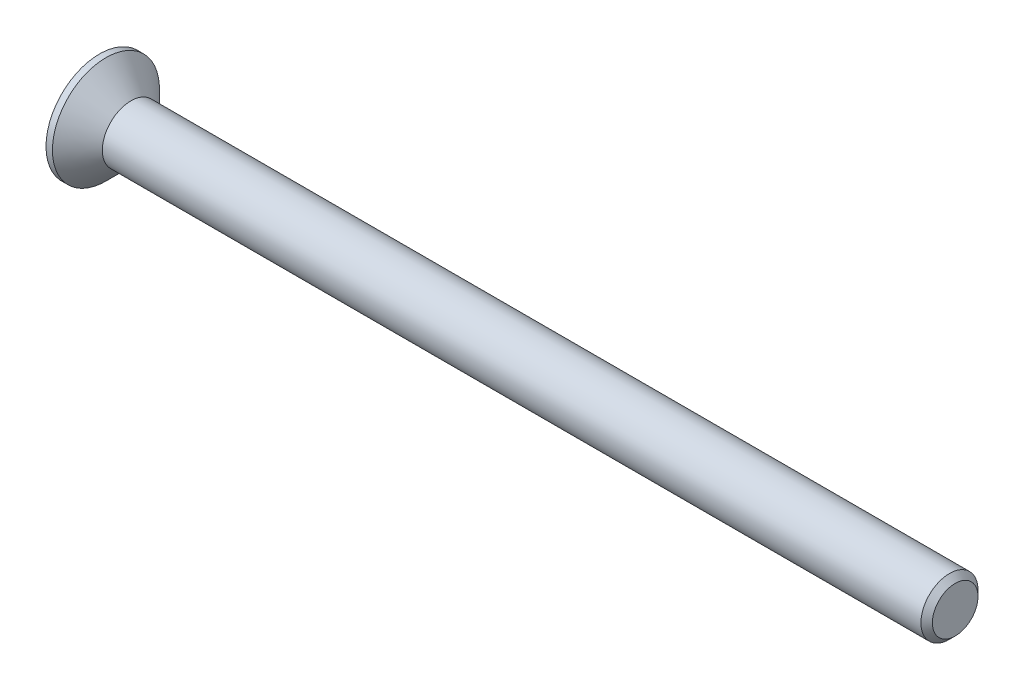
ISO-10303-21;
HEADER;
FILE_DESCRIPTION(('STEP AP214'),'2;1');
FILE_NAME('part.step','',(''),(''),'','','');
FILE_SCHEMA(('AUTOMOTIVE_DESIGN { 1 0 10303 214 1 1 1 1 }'));
ENDSEC;
DATA;
#1=APPLICATION_CONTEXT('core data for automotive mechanical design processes');
#2=APPLICATION_PROTOCOL_DEFINITION('international standard','automotive_design',2000,#1);
#3=PRODUCT_CONTEXT('',#1,'mechanical');
#4=PRODUCT('Part','Part','',(#3));
#5=PRODUCT_RELATED_PRODUCT_CATEGORY('part','',(#4));
#6=PRODUCT_DEFINITION_FORMATION('','',#4);
#7=PRODUCT_DEFINITION_CONTEXT('part definition',#1,'design');
#8=PRODUCT_DEFINITION('design','',#6,#7);
#9=PRODUCT_DEFINITION_SHAPE('','',#8);
#10=(LENGTH_UNIT() NAMED_UNIT(*) SI_UNIT(.MILLI.,.METRE.));
#11=(NAMED_UNIT(*) PLANE_ANGLE_UNIT() SI_UNIT($,.RADIAN.));
#12=(NAMED_UNIT(*) SI_UNIT($,.STERADIAN.) SOLID_ANGLE_UNIT());
#13=UNCERTAINTY_MEASURE_WITH_UNIT(LENGTH_MEASURE(1.E-05),#10,'distance_accuracy_value','');
#14=(GEOMETRIC_REPRESENTATION_CONTEXT(3) GLOBAL_UNCERTAINTY_ASSIGNED_CONTEXT((#13)) GLOBAL_UNIT_ASSIGNED_CONTEXT((#10,
#11,#12)) REPRESENTATION_CONTEXT('',''));
#15=CARTESIAN_POINT('',(0.,0.,0.));
#16=DIRECTION('',(0.,0.,1.));
#17=DIRECTION('',(1.,0.,0.));
#18=AXIS2_PLACEMENT_3D('',#15,#16,#17);
#19=CARTESIAN_POINT('',(0.,0.,0.));
#20=DIRECTION('',(-1.,0.,0.));
#21=DIRECTION('',(0.,0.,1.));
#22=AXIS2_PLACEMENT_3D('',#19,#20,#21);
#23=CONICAL_SURFACE('',#22,2.,0.78539816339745);
#24=CARTESIAN_POINT('',(-1.74999999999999,0.,0.));
#25=DIRECTION('',(-1.,0.,0.));
#26=DIRECTION('',(0.,0.,1.));
#27=AXIS2_PLACEMENT_3D('',#24,#25,#26);
#28=CIRCLE('',#27,3.75);
#29=CARTESIAN_POINT('',(-1.74999999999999,0.,3.75));
#30=VERTEX_POINT('',#29);
#31=EDGE_CURVE('E189',#30,#30,#28,.T.);
#32=ORIENTED_EDGE('',*,*,#31,.F.);
#33=EDGE_LOOP('',(#32));
#34=FACE_BOUND('',#33,.T.);
#35=CARTESIAN_POINT('',(0.,0.,0.));
#36=DIRECTION('',(-1.,0.,0.));
#37=DIRECTION('',(0.,0.,1.));
#38=AXIS2_PLACEMENT_3D('',#35,#36,#37);
#39=CIRCLE('',#38,2.);
#40=CARTESIAN_POINT('',(0.,0.,2.));
#41=VERTEX_POINT('',#40);
#42=EDGE_CURVE('E212',#41,#41,#39,.T.);
#43=ORIENTED_EDGE('',*,*,#42,.T.);
#44=EDGE_LOOP('',(#43));
#45=FACE_BOUND('',#44,.T.);
#46=ADVANCED_FACE('F33',(#34,#45),#23,.T.);
#47=CARTESIAN_POINT('',(-2.2,0.,0.));
#48=DIRECTION('',(-1.,0.,0.));
#49=DIRECTION('',(0.,0.,1.));
#50=AXIS2_PLACEMENT_3D('',#47,#48,#49);
#51=CYLINDRICAL_SURFACE('',#50,2.);
#52=CARTESIAN_POINT('',(57.4,0.,0.));
#53=DIRECTION('',(-1.,0.,0.));
#54=DIRECTION('',(0.,0.,1.));
#55=AXIS2_PLACEMENT_3D('',#52,#53,#54);
#56=CIRCLE('',#55,2.);
#57=CARTESIAN_POINT('',(57.4,0.,2.));
#58=VERTEX_POINT('',#57);
#59=EDGE_CURVE('E41',#58,#58,#56,.T.);
#60=ORIENTED_EDGE('',*,*,#59,.T.);
#61=EDGE_LOOP('',(#60));
#62=FACE_BOUND('',#61,.T.);
#63=ORIENTED_EDGE('',*,*,#42,.F.);
#64=EDGE_LOOP('',(#63));
#65=FACE_BOUND('',#64,.T.);
#66=ADVANCED_FACE('F217',(#62,#65),#51,.T.);
#67=CARTESIAN_POINT('',(57.8,0.,0.));
#68=DIRECTION('',(-1.,0.,0.));
#69=DIRECTION('',(0.,0.,1.));
#70=AXIS2_PLACEMENT_3D('',#67,#68,#69);
#71=PLANE('',#70);
#72=CARTESIAN_POINT('',(57.8,0.,0.));
#73=DIRECTION('',(-1.,0.,0.));
#74=DIRECTION('',(0.,0.,1.));
#75=AXIS2_PLACEMENT_3D('',#72,#73,#74);
#76=CIRCLE('',#75,1.59999999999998);
#77=CARTESIAN_POINT('',(57.8,0.,1.59999999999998));
#78=VERTEX_POINT('',#77);
#79=EDGE_CURVE('E11',#78,#78,#76,.F.);
#80=ORIENTED_EDGE('',*,*,#79,.T.);
#81=EDGE_LOOP('',(#80));
#82=FACE_BOUND('',#81,.T.);
#83=ADVANCED_FACE('F239',(#82),#71,.F.);
#84=CARTESIAN_POINT('',(-2.2,3.75,0.));
#85=DIRECTION('',(1.,0.,0.));
#86=DIRECTION('',(0.,0.,-1.));
#87=AXIS2_PLACEMENT_3D('',#84,#85,#86);
#88=PLANE('',#87);
#89=DIRECTION('',(0.,0.,-1.));
#90=VECTOR('',#89,1.);
#91=CARTESIAN_POINT('',(-2.2,0.55,-2.2));
#92=LINE('',#91,#90);
#93=CARTESIAN_POINT('',(-2.2,0.55,-0.55));
#94=VERTEX_POINT('',#93);
#95=CARTESIAN_POINT('',(-2.2,0.55,-2.2));
#96=VERTEX_POINT('',#95);
#97=EDGE_CURVE('E158',#94,#96,#92,.T.);
#98=ORIENTED_EDGE('',*,*,#97,.F.);
#99=DIRECTION('',(0.,-1.,0.));
#100=VECTOR('',#99,1.);
#101=CARTESIAN_POINT('',(-2.2,0.55,-0.55));
#102=LINE('',#101,#100);
#103=CARTESIAN_POINT('',(-2.2,2.2,-0.55));
#104=VERTEX_POINT('',#103);
#105=EDGE_CURVE('E48',#104,#94,#102,.T.);
#106=ORIENTED_EDGE('',*,*,#105,.F.);
#107=DIRECTION('',(0.,0.,-1.));
#108=VECTOR('',#107,1.);
#109=CARTESIAN_POINT('',(-2.2,2.2,-0.55));
#110=LINE('',#109,#108);
#111=CARTESIAN_POINT('',(-2.2,2.2,0.55));
#112=VERTEX_POINT('',#111);
#113=EDGE_CURVE('E185',#112,#104,#110,.T.);
#114=ORIENTED_EDGE('',*,*,#113,.F.);
#115=DIRECTION('',(0.,1.,0.));
#116=VECTOR('',#115,1.);
#117=CARTESIAN_POINT('',(-2.2,2.2,0.55));
#118=LINE('',#117,#116);
#119=CARTESIAN_POINT('',(-2.2,0.55,0.55));
#120=VERTEX_POINT('',#119);
#121=EDGE_CURVE('E183',#120,#112,#118,.T.);
#122=ORIENTED_EDGE('',*,*,#121,.F.);
#123=DIRECTION('',(0.,0.,-1.));
#124=VECTOR('',#123,1.);
#125=CARTESIAN_POINT('',(-2.2,0.55,0.55));
#126=LINE('',#125,#124);
#127=CARTESIAN_POINT('',(-2.2,0.55,2.2));
#128=VERTEX_POINT('',#127);
#129=EDGE_CURVE('E132',#128,#120,#126,.T.);
#130=ORIENTED_EDGE('',*,*,#129,.F.);
#131=DIRECTION('',(0.,1.,0.));
#132=VECTOR('',#131,1.);
#133=CARTESIAN_POINT('',(-2.2,0.55,2.2));
#134=LINE('',#133,#132);
#135=CARTESIAN_POINT('',(-2.2,-0.55,2.2));
#136=VERTEX_POINT('',#135);
#137=EDGE_CURVE('E179',#136,#128,#134,.T.);
#138=ORIENTED_EDGE('',*,*,#137,.F.);
#139=DIRECTION('',(0.,0.,1.));
#140=VECTOR('',#139,1.);
#141=CARTESIAN_POINT('',(-2.2,-0.55,2.2));
#142=LINE('',#141,#140);
#143=CARTESIAN_POINT('',(-2.2,-0.55,0.55));
#144=VERTEX_POINT('',#143);
#145=EDGE_CURVE('E176',#144,#136,#142,.T.);
#146=ORIENTED_EDGE('',*,*,#145,.F.);
#147=DIRECTION('',(0.,1.,0.));
#148=VECTOR('',#147,1.);
#149=CARTESIAN_POINT('',(-2.2,-0.55,0.55));
#150=LINE('',#149,#148);
#151=CARTESIAN_POINT('',(-2.2,-2.2,0.55));
#152=VERTEX_POINT('',#151);
#153=EDGE_CURVE('E173',#152,#144,#150,.T.);
#154=ORIENTED_EDGE('',*,*,#153,.F.);
#155=DIRECTION('',(0.,0.,1.));
#156=VECTOR('',#155,1.);
#157=CARTESIAN_POINT('',(-2.2,-2.2,0.55));
#158=LINE('',#157,#156);
#159=CARTESIAN_POINT('',(-2.2,-2.2,-0.55));
#160=VERTEX_POINT('',#159);
#161=EDGE_CURVE('E170',#160,#152,#158,.T.);
#162=ORIENTED_EDGE('',*,*,#161,.F.);
#163=DIRECTION('',(0.,-1.,0.));
#164=VECTOR('',#163,1.);
#165=CARTESIAN_POINT('',(-2.2,-2.2,-0.55));
#166=LINE('',#165,#164);
#167=CARTESIAN_POINT('',(-2.2,-0.55,-0.55));
#168=VERTEX_POINT('',#167);
#169=EDGE_CURVE('E167',#168,#160,#166,.T.);
#170=ORIENTED_EDGE('',*,*,#169,.F.);
#171=DIRECTION('',(0.,0.,1.));
#172=VECTOR('',#171,1.);
#173=CARTESIAN_POINT('',(-2.2,-0.55,-0.55));
#174=LINE('',#173,#172);
#175=CARTESIAN_POINT('',(-2.2,-0.55,-2.2));
#176=VERTEX_POINT('',#175);
#177=EDGE_CURVE('E164',#176,#168,#174,.T.);
#178=ORIENTED_EDGE('',*,*,#177,.F.);
#179=DIRECTION('',(0.,-1.,0.));
#180=VECTOR('',#179,1.);
#181=CARTESIAN_POINT('',(-2.2,-0.55,-2.2));
#182=LINE('',#181,#180);
#183=EDGE_CURVE('E161',#96,#176,#182,.T.);
#184=ORIENTED_EDGE('',*,*,#183,.F.);
#185=EDGE_LOOP('',(#98,#106,#114,#122,#130,#138,#146,#154,#162,#170,#178,#184));
#186=FACE_BOUND('',#185,.T.);
#187=CARTESIAN_POINT('',(-2.2,0.,0.));
#188=DIRECTION('',(-1.,0.,0.));
#189=DIRECTION('',(0.,0.,1.));
#190=AXIS2_PLACEMENT_3D('',#187,#188,#189);
#191=CIRCLE('',#190,3.75);
#192=CARTESIAN_POINT('',(-2.2,0.,3.75));
#193=VERTEX_POINT('',#192);
#194=EDGE_CURVE('E209',#193,#193,#191,.T.);
#195=ORIENTED_EDGE('',*,*,#194,.T.);
#196=EDGE_LOOP('',(#195));
#197=FACE_BOUND('',#196,.T.);
#198=ADVANCED_FACE('F230',(#186,#197),#88,.F.);
#199=CARTESIAN_POINT('',(-2.2,0.,0.));
#200=DIRECTION('',(-1.,0.,0.));
#201=DIRECTION('',(0.,0.,1.));
#202=AXIS2_PLACEMENT_3D('',#199,#200,#201);
#203=CYLINDRICAL_SURFACE('',#202,3.75);
#204=ORIENTED_EDGE('',*,*,#194,.F.);
#205=EDGE_LOOP('',(#204));
#206=FACE_BOUND('',#205,.T.);
#207=ORIENTED_EDGE('',*,*,#31,.T.);
#208=EDGE_LOOP('',(#207));
#209=FACE_BOUND('',#208,.T.);
#210=ADVANCED_FACE('F222',(#206,#209),#203,.T.);
#211=CARTESIAN_POINT('',(57.4,0.,0.));
#212=DIRECTION('',(-1.,0.,0.));
#213=DIRECTION('',(0.,0.,1.));
#214=AXIS2_PLACEMENT_3D('',#211,#212,#213);
#215=CONICAL_SURFACE('',#214,2.,0.785398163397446);
#216=ORIENTED_EDGE('',*,*,#79,.F.);
#217=EDGE_LOOP('',(#216));
#218=FACE_BOUND('',#217,.T.);
#219=ORIENTED_EDGE('',*,*,#59,.F.);
#220=EDGE_LOOP('',(#219));
#221=FACE_BOUND('',#220,.T.);
#222=ADVANCED_FACE('F35',(#218,#221),#215,.T.);
#223=CARTESIAN_POINT('',(-0.3,0.55,-0.55));
#224=DIRECTION('',(0.,0.,-1.));
#225=DIRECTION('',(-1.,0.,0.));
#226=AXIS2_PLACEMENT_3D('',#223,#224,#225);
#227=PLANE('',#226);
#228=ORIENTED_EDGE('',*,*,#105,.T.);
#229=DIRECTION('',(-1.,0.,0.));
#230=VECTOR('',#229,1.);
#231=CARTESIAN_POINT('',(-0.3,0.55,-0.55));
#232=LINE('',#231,#230);
#233=CARTESIAN_POINT('',(-0.3,0.55,-0.55));
#234=VERTEX_POINT('',#233);
#235=EDGE_CURVE('E96',#234,#94,#232,.T.);
#236=ORIENTED_EDGE('',*,*,#235,.F.);
#237=DIRECTION('',(0.,-1.,0.));
#238=VECTOR('',#237,1.);
#239=CARTESIAN_POINT('',(-0.3,0.55,-0.55));
#240=LINE('',#239,#238);
#241=CARTESIAN_POINT('',(-0.3,2.2,-0.55));
#242=VERTEX_POINT('',#241);
#243=EDGE_CURVE('E187',#242,#234,#240,.T.);
#244=ORIENTED_EDGE('',*,*,#243,.F.);
#245=DIRECTION('',(-1.,0.,0.));
#246=VECTOR('',#245,1.);
#247=CARTESIAN_POINT('',(-0.3,2.2,-0.55));
#248=LINE('',#247,#246);
#249=EDGE_CURVE('E56',#242,#104,#248,.T.);
#250=ORIENTED_EDGE('',*,*,#249,.T.);
#251=EDGE_LOOP('',(#228,#236,#244,#250));
#252=FACE_BOUND('',#251,.T.);
#253=ADVANCED_FACE('F221',(#252),#227,.F.);
#254=CARTESIAN_POINT('',(-0.3,2.2,-0.55));
#255=DIRECTION('',(0.,1.,0.));
#256=DIRECTION('',(-1.,0.,0.));
#257=AXIS2_PLACEMENT_3D('',#254,#255,#256);
#258=PLANE('',#257);
#259=ORIENTED_EDGE('',*,*,#113,.T.);
#260=ORIENTED_EDGE('',*,*,#249,.F.);
#261=DIRECTION('',(0.,0.,-1.));
#262=VECTOR('',#261,1.);
#263=CARTESIAN_POINT('',(-0.3,2.2,-0.55));
#264=LINE('',#263,#262);
#265=CARTESIAN_POINT('',(-0.3,2.2,0.55));
#266=VERTEX_POINT('',#265);
#267=EDGE_CURVE('E144',#266,#242,#264,.T.);
#268=ORIENTED_EDGE('',*,*,#267,.F.);
#269=DIRECTION('',(-1.,0.,0.));
#270=VECTOR('',#269,1.);
#271=CARTESIAN_POINT('',(-0.3,2.2,0.55));
#272=LINE('',#271,#270);
#273=EDGE_CURVE('E136',#266,#112,#272,.T.);
#274=ORIENTED_EDGE('',*,*,#273,.T.);
#275=EDGE_LOOP('',(#259,#260,#268,#274));
#276=FACE_BOUND('',#275,.T.);
#277=ADVANCED_FACE('F228',(#276),#258,.F.);
#278=CARTESIAN_POINT('',(-0.3,2.2,0.55));
#279=DIRECTION('',(0.,0.,1.));
#280=DIRECTION('',(1.,0.,0.));
#281=AXIS2_PLACEMENT_3D('',#278,#279,#280);
#282=PLANE('',#281);
#283=ORIENTED_EDGE('',*,*,#121,.T.);
#284=ORIENTED_EDGE('',*,*,#273,.F.);
#285=DIRECTION('',(0.,1.,0.));
#286=VECTOR('',#285,1.);
#287=CARTESIAN_POINT('',(-0.3,2.2,0.55));
#288=LINE('',#287,#286);
#289=CARTESIAN_POINT('',(-0.3,0.55,0.55));
#290=VERTEX_POINT('',#289);
#291=EDGE_CURVE('E140',#290,#266,#288,.T.);
#292=ORIENTED_EDGE('',*,*,#291,.F.);
#293=DIRECTION('',(-1.,0.,0.));
#294=VECTOR('',#293,1.);
#295=CARTESIAN_POINT('',(-0.3,0.55,0.55));
#296=LINE('',#295,#294);
#297=EDGE_CURVE('E125',#290,#120,#296,.T.);
#298=ORIENTED_EDGE('',*,*,#297,.T.);
#299=EDGE_LOOP('',(#283,#284,#292,#298));
#300=FACE_BOUND('',#299,.T.);
#301=ADVANCED_FACE('F141',(#300),#282,.F.);
#302=CARTESIAN_POINT('',(-0.3,0.55,0.55));
#303=DIRECTION('',(0.,1.,0.));
#304=DIRECTION('',(-1.,0.,0.));
#305=AXIS2_PLACEMENT_3D('',#302,#303,#304);
#306=PLANE('',#305);
#307=ORIENTED_EDGE('',*,*,#129,.T.);
#308=ORIENTED_EDGE('',*,*,#297,.F.);
#309=DIRECTION('',(0.,0.,-1.));
#310=VECTOR('',#309,1.);
#311=CARTESIAN_POINT('',(-0.3,0.55,0.55));
#312=LINE('',#311,#310);
#313=CARTESIAN_POINT('',(-0.3,0.55,2.2));
#314=VERTEX_POINT('',#313);
#315=EDGE_CURVE('E129',#314,#290,#312,.T.);
#316=ORIENTED_EDGE('',*,*,#315,.F.);
#317=DIRECTION('',(-1.,0.,0.));
#318=VECTOR('',#317,1.);
#319=CARTESIAN_POINT('',(-0.3,0.55,2.2));
#320=LINE('',#319,#318);
#321=EDGE_CURVE('E137',#314,#128,#320,.T.);
#322=ORIENTED_EDGE('',*,*,#321,.T.);
#323=EDGE_LOOP('',(#307,#308,#316,#322));
#324=FACE_BOUND('',#323,.T.);
#325=ADVANCED_FACE('F127',(#324),#306,.F.);
#326=CARTESIAN_POINT('',(-0.3,0.55,2.2));
#327=DIRECTION('',(0.,0.,1.));
#328=DIRECTION('',(1.,0.,0.));
#329=AXIS2_PLACEMENT_3D('',#326,#327,#328);
#330=PLANE('',#329);
#331=ORIENTED_EDGE('',*,*,#137,.T.);
#332=ORIENTED_EDGE('',*,*,#321,.F.);
#333=DIRECTION('',(0.,1.,0.));
#334=VECTOR('',#333,1.);
#335=CARTESIAN_POINT('',(-0.3,0.55,2.2));
#336=LINE('',#335,#334);
#337=CARTESIAN_POINT('',(-0.3,-0.55,2.2));
#338=VERTEX_POINT('',#337);
#339=EDGE_CURVE('E150',#338,#314,#336,.T.);
#340=ORIENTED_EDGE('',*,*,#339,.F.);
#341=DIRECTION('',(-1.,0.,0.));
#342=VECTOR('',#341,1.);
#343=CARTESIAN_POINT('',(-0.3,-0.55,2.2));
#344=LINE('',#343,#342);
#345=EDGE_CURVE('E192',#338,#136,#344,.T.);
#346=ORIENTED_EDGE('',*,*,#345,.T.);
#347=EDGE_LOOP('',(#331,#332,#340,#346));
#348=FACE_BOUND('',#347,.T.);
#349=ADVANCED_FACE('F277',(#348),#330,.F.);
#350=CARTESIAN_POINT('',(-0.3,-0.55,2.2));
#351=DIRECTION('',(0.,-1.,0.));
#352=DIRECTION('',(1.,0.,0.));
#353=AXIS2_PLACEMENT_3D('',#350,#351,#352);
#354=PLANE('',#353);
#355=ORIENTED_EDGE('',*,*,#145,.T.);
#356=ORIENTED_EDGE('',*,*,#345,.F.);
#357=DIRECTION('',(0.,0.,1.));
#358=VECTOR('',#357,1.);
#359=CARTESIAN_POINT('',(-0.3,-0.55,2.2));
#360=LINE('',#359,#358);
#361=CARTESIAN_POINT('',(-0.3,-0.55,0.55));
#362=VERTEX_POINT('',#361);
#363=EDGE_CURVE('E152',#362,#338,#360,.T.);
#364=ORIENTED_EDGE('',*,*,#363,.F.);
#365=DIRECTION('',(-1.,0.,0.));
#366=VECTOR('',#365,1.);
#367=CARTESIAN_POINT('',(-0.3,-0.55,0.55));
#368=LINE('',#367,#366);
#369=EDGE_CURVE('E194',#362,#144,#368,.T.);
#370=ORIENTED_EDGE('',*,*,#369,.T.);
#371=EDGE_LOOP('',(#355,#356,#364,#370));
#372=FACE_BOUND('',#371,.T.);
#373=ADVANCED_FACE('F273',(#372),#354,.F.);
#374=CARTESIAN_POINT('',(-0.3,-0.55,0.55));
#375=DIRECTION('',(0.,0.,1.));
#376=DIRECTION('',(1.,0.,0.));
#377=AXIS2_PLACEMENT_3D('',#374,#375,#376);
#378=PLANE('',#377);
#379=ORIENTED_EDGE('',*,*,#153,.T.);
#380=ORIENTED_EDGE('',*,*,#369,.F.);
#381=DIRECTION('',(0.,1.,0.));
#382=VECTOR('',#381,1.);
#383=CARTESIAN_POINT('',(-0.3,-0.55,0.55));
#384=LINE('',#383,#382);
#385=CARTESIAN_POINT('',(-0.3,-2.2,0.55));
#386=VERTEX_POINT('',#385);
#387=EDGE_CURVE('E422',#386,#362,#384,.T.);
#388=ORIENTED_EDGE('',*,*,#387,.F.);
#389=DIRECTION('',(-1.,0.,0.));
#390=VECTOR('',#389,1.);
#391=CARTESIAN_POINT('',(-0.3,-2.2,0.55));
#392=LINE('',#391,#390);
#393=EDGE_CURVE('E196',#386,#152,#392,.T.);
#394=ORIENTED_EDGE('',*,*,#393,.T.);
#395=EDGE_LOOP('',(#379,#380,#388,#394));
#396=FACE_BOUND('',#395,.T.);
#397=ADVANCED_FACE('F269',(#396),#378,.F.);
#398=CARTESIAN_POINT('',(-0.3,-2.2,0.55));
#399=DIRECTION('',(0.,-1.,0.));
#400=DIRECTION('',(1.,0.,0.));
#401=AXIS2_PLACEMENT_3D('',#398,#399,#400);
#402=PLANE('',#401);
#403=ORIENTED_EDGE('',*,*,#161,.T.);
#404=ORIENTED_EDGE('',*,*,#393,.F.);
#405=DIRECTION('',(0.,0.,1.));
#406=VECTOR('',#405,1.);
#407=CARTESIAN_POINT('',(-0.3,-2.2,0.55));
#408=LINE('',#407,#406);
#409=CARTESIAN_POINT('',(-0.3,-2.2,-0.55));
#410=VERTEX_POINT('',#409);
#411=EDGE_CURVE('E419',#410,#386,#408,.T.);
#412=ORIENTED_EDGE('',*,*,#411,.F.);
#413=DIRECTION('',(-1.,0.,0.));
#414=VECTOR('',#413,1.);
#415=CARTESIAN_POINT('',(-0.3,-2.2,-0.55));
#416=LINE('',#415,#414);
#417=EDGE_CURVE('E198',#410,#160,#416,.T.);
#418=ORIENTED_EDGE('',*,*,#417,.T.);
#419=EDGE_LOOP('',(#403,#404,#412,#418));
#420=FACE_BOUND('',#419,.T.);
#421=ADVANCED_FACE('F265',(#420),#402,.F.);
#422=CARTESIAN_POINT('',(-0.3,-2.2,-0.55));
#423=DIRECTION('',(0.,0.,-1.));
#424=DIRECTION('',(-1.,0.,0.));
#425=AXIS2_PLACEMENT_3D('',#422,#423,#424);
#426=PLANE('',#425);
#427=ORIENTED_EDGE('',*,*,#169,.T.);
#428=ORIENTED_EDGE('',*,*,#417,.F.);
#429=DIRECTION('',(0.,-1.,0.));
#430=VECTOR('',#429,1.);
#431=CARTESIAN_POINT('',(-0.3,-2.2,-0.55));
#432=LINE('',#431,#430);
#433=CARTESIAN_POINT('',(-0.3,-0.55,-0.55));
#434=VERTEX_POINT('',#433);
#435=EDGE_CURVE('E416',#434,#410,#432,.T.);
#436=ORIENTED_EDGE('',*,*,#435,.F.);
#437=DIRECTION('',(-1.,0.,0.));
#438=VECTOR('',#437,1.);
#439=CARTESIAN_POINT('',(-0.3,-0.55,-0.55));
#440=LINE('',#439,#438);
#441=EDGE_CURVE('E200',#434,#168,#440,.T.);
#442=ORIENTED_EDGE('',*,*,#441,.T.);
#443=EDGE_LOOP('',(#427,#428,#436,#442));
#444=FACE_BOUND('',#443,.T.);
#445=ADVANCED_FACE('F261',(#444),#426,.F.);
#446=CARTESIAN_POINT('',(-0.3,-0.55,-0.55));
#447=DIRECTION('',(0.,-1.,0.));
#448=DIRECTION('',(1.,0.,0.));
#449=AXIS2_PLACEMENT_3D('',#446,#447,#448);
#450=PLANE('',#449);
#451=ORIENTED_EDGE('',*,*,#177,.T.);
#452=ORIENTED_EDGE('',*,*,#441,.F.);
#453=DIRECTION('',(0.,0.,1.));
#454=VECTOR('',#453,1.);
#455=CARTESIAN_POINT('',(-0.3,-0.55,-0.55));
#456=LINE('',#455,#454);
#457=CARTESIAN_POINT('',(-0.3,-0.55,-2.2));
#458=VERTEX_POINT('',#457);
#459=EDGE_CURVE('E413',#458,#434,#456,.T.);
#460=ORIENTED_EDGE('',*,*,#459,.F.);
#461=DIRECTION('',(-1.,0.,0.));
#462=VECTOR('',#461,1.);
#463=CARTESIAN_POINT('',(-0.3,-0.55,-2.2));
#464=LINE('',#463,#462);
#465=EDGE_CURVE('E202',#458,#176,#464,.T.);
#466=ORIENTED_EDGE('',*,*,#465,.T.);
#467=EDGE_LOOP('',(#451,#452,#460,#466));
#468=FACE_BOUND('',#467,.T.);
#469=ADVANCED_FACE('F257',(#468),#450,.F.);
#470=CARTESIAN_POINT('',(-0.3,-0.55,-2.2));
#471=DIRECTION('',(0.,0.,-1.));
#472=DIRECTION('',(-1.,0.,0.));
#473=AXIS2_PLACEMENT_3D('',#470,#471,#472);
#474=PLANE('',#473);
#475=ORIENTED_EDGE('',*,*,#183,.T.);
#476=ORIENTED_EDGE('',*,*,#465,.F.);
#477=DIRECTION('',(0.,-1.,0.));
#478=VECTOR('',#477,1.);
#479=CARTESIAN_POINT('',(-0.3,-0.55,-2.2));
#480=LINE('',#479,#478);
#481=CARTESIAN_POINT('',(-0.3,0.55,-2.2));
#482=VERTEX_POINT('',#481);
#483=EDGE_CURVE('E408',#482,#458,#480,.T.);
#484=ORIENTED_EDGE('',*,*,#483,.F.);
#485=DIRECTION('',(-1.,0.,0.));
#486=VECTOR('',#485,1.);
#487=CARTESIAN_POINT('',(-0.3,0.55,-2.2));
#488=LINE('',#487,#486);
#489=EDGE_CURVE('E204',#482,#96,#488,.T.);
#490=ORIENTED_EDGE('',*,*,#489,.T.);
#491=EDGE_LOOP('',(#475,#476,#484,#490));
#492=FACE_BOUND('',#491,.T.);
#493=ADVANCED_FACE('F253',(#492),#474,.F.);
#494=CARTESIAN_POINT('',(-0.3,0.55,-2.2));
#495=DIRECTION('',(0.,1.,0.));
#496=DIRECTION('',(-1.,0.,0.));
#497=AXIS2_PLACEMENT_3D('',#494,#495,#496);
#498=PLANE('',#497);
#499=ORIENTED_EDGE('',*,*,#97,.T.);
#500=ORIENTED_EDGE('',*,*,#489,.F.);
#501=DIRECTION('',(0.,0.,-1.));
#502=VECTOR('',#501,1.);
#503=CARTESIAN_POINT('',(-0.3,0.55,-2.2));
#504=LINE('',#503,#502);
#505=EDGE_CURVE('E406',#234,#482,#504,.T.);
#506=ORIENTED_EDGE('',*,*,#505,.F.);
#507=ORIENTED_EDGE('',*,*,#235,.T.);
#508=EDGE_LOOP('',(#499,#500,#506,#507));
#509=FACE_BOUND('',#508,.T.);
#510=ADVANCED_FACE('F250',(#509),#498,.F.);
#511=CARTESIAN_POINT('',(-0.3,0.,0.));
#512=DIRECTION('',(1.,0.,0.));
#513=DIRECTION('',(0.,0.,-1.));
#514=AXIS2_PLACEMENT_3D('',#511,#512,#513);
#515=PLANE('',#514);
#516=ORIENTED_EDGE('',*,*,#243,.T.);
#517=ORIENTED_EDGE('',*,*,#505,.T.);
#518=ORIENTED_EDGE('',*,*,#483,.T.);
#519=ORIENTED_EDGE('',*,*,#459,.T.);
#520=ORIENTED_EDGE('',*,*,#435,.T.);
#521=ORIENTED_EDGE('',*,*,#411,.T.);
#522=ORIENTED_EDGE('',*,*,#387,.T.);
#523=ORIENTED_EDGE('',*,*,#363,.T.);
#524=ORIENTED_EDGE('',*,*,#339,.T.);
#525=ORIENTED_EDGE('',*,*,#315,.T.);
#526=ORIENTED_EDGE('',*,*,#291,.T.);
#527=ORIENTED_EDGE('',*,*,#267,.T.);
#528=EDGE_LOOP('',(#516,#517,#518,#519,#520,#521,#522,#523,#524,#525,#526,#527));
#529=FACE_BOUND('',#528,.T.);
#530=ADVANCED_FACE('F147',(#529),#515,.F.);
#531=CLOSED_SHELL('',(#46,#66,#83,#198,#210,#222,#253,#277,#301,#325,#349,#373,#397,#421,#445,
#469,#493,#510,#530));
#532=MANIFOLD_SOLID_BREP('B2',#531);
#533=ADVANCED_BREP_SHAPE_REPRESENTATION('',(#18,#532),#14);
#534=SHAPE_DEFINITION_REPRESENTATION(#9,#533);
ENDSEC;
END-ISO-10303-21;
